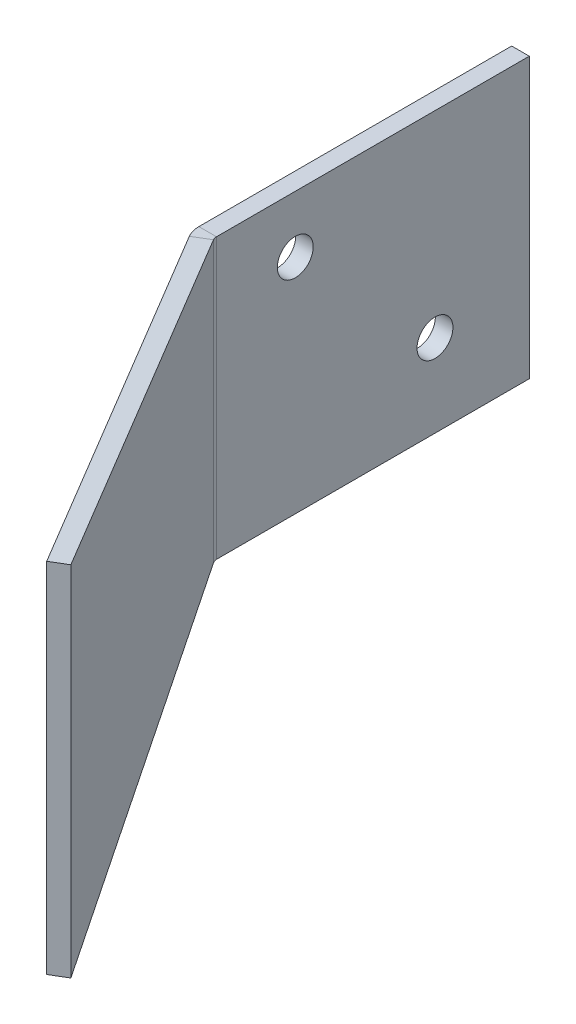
ISO-10303-21;
HEADER;
FILE_DESCRIPTION(('STEP AP214'),'2;1');
FILE_NAME('part.step','',(''),(''),'','','');
FILE_SCHEMA(('AUTOMOTIVE_DESIGN { 1 0 10303 214 1 1 1 1 }'));
ENDSEC;
DATA;
#1=APPLICATION_CONTEXT('core data for automotive mechanical design processes');
#2=APPLICATION_PROTOCOL_DEFINITION('international standard','automotive_design',2000,#1);
#3=PRODUCT_CONTEXT('',#1,'mechanical');
#4=PRODUCT('Part','Part','',(#3));
#5=PRODUCT_RELATED_PRODUCT_CATEGORY('part','',(#4));
#6=PRODUCT_DEFINITION_FORMATION('','',#4);
#7=PRODUCT_DEFINITION_CONTEXT('part definition',#1,'design');
#8=PRODUCT_DEFINITION('design','',#6,#7);
#9=PRODUCT_DEFINITION_SHAPE('','',#8);
#10=(LENGTH_UNIT() NAMED_UNIT(*) SI_UNIT(.MILLI.,.METRE.));
#11=(NAMED_UNIT(*) PLANE_ANGLE_UNIT() SI_UNIT($,.RADIAN.));
#12=(NAMED_UNIT(*) SI_UNIT($,.STERADIAN.) SOLID_ANGLE_UNIT());
#13=UNCERTAINTY_MEASURE_WITH_UNIT(LENGTH_MEASURE(1.E-05),#10,'distance_accuracy_value','');
#14=(GEOMETRIC_REPRESENTATION_CONTEXT(3) GLOBAL_UNCERTAINTY_ASSIGNED_CONTEXT((#13)) GLOBAL_UNIT_ASSIGNED_CONTEXT((#10,
#11,#12)) REPRESENTATION_CONTEXT('',''));
#15=CARTESIAN_POINT('',(0.,0.,0.));
#16=DIRECTION('',(0.,0.,1.));
#17=DIRECTION('',(1.,0.,0.));
#18=AXIS2_PLACEMENT_3D('',#15,#16,#17);
#19=CARTESIAN_POINT('',(-1.6002,-19.396714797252,-15.875));
#20=DIRECTION('',(0.,0.,-1.));
#21=DIRECTION('',(-1.,0.,0.));
#22=AXIS2_PLACEMENT_3D('',#19,#20,#21);
#23=PLANE('',#22);
#24=DIRECTION('',(0.,1.,0.));
#25=VECTOR('',#24,1.);
#26=CARTESIAN_POINT('',(-1.6002,-19.396714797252,-15.875));
#27=LINE('',#26,#25);
#28=CARTESIAN_POINT('',(-1.6002,-19.396714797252,-15.875));
#29=VERTEX_POINT('',#28);
#30=CARTESIAN_POINT('',(-1.6002,6.00328520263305,-15.875));
#31=VERTEX_POINT('',#30);
#32=EDGE_CURVE('E216',#29,#31,#27,.T.);
#33=ORIENTED_EDGE('',*,*,#32,.T.);
#34=DIRECTION('',(1.,0.,0.));
#35=VECTOR('',#34,1.);
#36=CARTESIAN_POINT('',(0.,6.00328520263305,-15.875));
#37=LINE('',#36,#35);
#38=CARTESIAN_POINT('',(0.,6.00328520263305,-15.875));
#39=VERTEX_POINT('',#38);
#40=EDGE_CURVE('E218',#39,#31,#37,.F.);
#41=ORIENTED_EDGE('',*,*,#40,.F.);
#42=DIRECTION('',(0.,1.,0.));
#43=VECTOR('',#42,1.);
#44=CARTESIAN_POINT('',(0.,-19.396714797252,-15.875));
#45=LINE('',#44,#43);
#46=CARTESIAN_POINT('',(0.,-19.396714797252,-15.875));
#47=VERTEX_POINT('',#46);
#48=EDGE_CURVE('E225',#47,#39,#45,.T.);
#49=ORIENTED_EDGE('',*,*,#48,.F.);
#50=DIRECTION('',(1.,0.,0.));
#51=VECTOR('',#50,1.);
#52=CARTESIAN_POINT('',(-1.6002,-19.396714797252,-15.875));
#53=LINE('',#52,#51);
#54=EDGE_CURVE('E13',#29,#47,#53,.T.);
#55=ORIENTED_EDGE('',*,*,#54,.F.);
#56=EDGE_LOOP('',(#33,#41,#49,#55));
#57=FACE_BOUND('',#56,.T.);
#58=ADVANCED_FACE('F59',(#57),#23,.T.);
#59=CARTESIAN_POINT('',(0.73660000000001,-19.4327343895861,12.5637679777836));
#60=DIRECTION('',(0.,-1.,0.));
#61=DIRECTION('',(-0.857167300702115,0.,0.515038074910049));
#62=AXIS2_PLACEMENT_3D('',#59,#60,#61);
#63=CYLINDRICAL_SURFACE('',#62,2.33679999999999);
#64=DIRECTION('',(0.,-1.,0.));
#65=VECTOR('',#64,1.);
#66=CARTESIAN_POINT('',(-1.26642854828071,19.396714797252,13.7673089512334));
#67=LINE('',#66,#65);
#68=CARTESIAN_POINT('',(-1.2664285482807,-19.4327343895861,13.7673089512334));
#69=VERTEX_POINT('',#68);
#70=CARTESIAN_POINT('',(-1.26642854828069,6.00810081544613,13.7673089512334));
#71=VERTEX_POINT('',#70);
#72=EDGE_CURVE('E145',#69,#71,#67,.F.);
#73=ORIENTED_EDGE('',*,*,#72,.T.);
#74=CARTESIAN_POINT('',(-1.2664285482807,6.00810081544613,13.7673089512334));
#75=CARTESIAN_POINT('',(-1.27999492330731,6.00800049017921,13.7447310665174));
#76=CARTESIAN_POINT('',(-1.29317923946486,6.00790016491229,13.7219236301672));
#77=CARTESIAN_POINT('',(-1.31876938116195,6.00769951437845,13.6758761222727));
#78=CARTESIAN_POINT('',(-1.3311752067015,6.00759918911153,13.6526360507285));
#79=CARTESIAN_POINT('',(-1.35519399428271,6.00739853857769,13.6057497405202));
#80=CARTESIAN_POINT('',(-1.36680695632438,6.00729821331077,13.5821035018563));
#81=CARTESIAN_POINT('',(-1.38922678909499,6.00709756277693,13.5344319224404));
#82=CARTESIAN_POINT('',(-1.40003365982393,6.00699723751,13.5104065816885));
#83=CARTESIAN_POINT('',(-1.42082893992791,6.00679658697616,13.4620042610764));
#84=CARTESIAN_POINT('',(-1.43081734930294,6.00669626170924,13.4376272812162));
#85=CARTESIAN_POINT('',(-1.44996428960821,6.0064956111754,13.3885495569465));
#86=CARTESIAN_POINT('',(-1.45912282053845,6.00639528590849,13.363848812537));
#87=CARTESIAN_POINT('',(-1.47659953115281,6.00619463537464,13.3141518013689));
#88=CARTESIAN_POINT('',(-1.48491771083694,6.00609431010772,13.2891555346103));
#89=CARTESIAN_POINT('',(-1.50070420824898,6.00589365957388,13.2388960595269));
#90=CARTESIAN_POINT('',(-1.50817252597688,6.00579333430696,13.213632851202));
#91=CARTESIAN_POINT('',(-1.52225076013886,6.00559268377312,13.1628683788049));
#92=CARTESIAN_POINT('',(-1.52886067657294,6.0054923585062,13.1373671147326));
#93=CARTESIAN_POINT('',(-1.5412145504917,6.00529170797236,13.0861556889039));
#94=CARTESIAN_POINT('',(-1.54695850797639,6.00519138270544,13.0604455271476));
#95=CARTESIAN_POINT('',(-1.55757389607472,6.0049907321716,13.0088457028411));
#96=CARTESIAN_POINT('',(-1.56244532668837,6.00489040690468,12.9829560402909));
#97=CARTESIAN_POINT('',(-1.57131009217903,6.00468975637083,12.9310268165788));
#98=CARTESIAN_POINT('',(-1.57530342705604,6.00458943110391,12.9049872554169));
#99=CARTESIAN_POINT('',(-1.58240743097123,6.00438878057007,12.8527880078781));
#100=CARTESIAN_POINT('',(-1.58551810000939,6.00428845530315,12.8266283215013));
#101=CARTESIAN_POINT('',(-1.59085323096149,6.00408780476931,12.7742187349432));
#102=CARTESIAN_POINT('',(-1.59307769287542,6.00398747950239,12.7479688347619));
#103=CARTESIAN_POINT('',(-1.59663780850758,6.00378682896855,12.6954088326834));
#104=CARTESIAN_POINT('',(-1.59797346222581,6.00368650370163,12.6690987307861));
#105=CARTESIAN_POINT('',(-1.59975464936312,6.00348585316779,12.6164484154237));
#106=CARTESIAN_POINT('',(-1.6002001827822,6.00338552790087,12.5901082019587));
#107=CARTESIAN_POINT('',(-1.6002,6.00328520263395,12.5637679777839));
#108=B_SPLINE_CURVE_WITH_KNOTS('',3,(#74,#75,#76,#77,#78,#79,#80,#81,#82,#83,#84,#85,#86,#87,
#88,#89,#90,#91,#92,#93,#94,#95,#96,#97,#98,#99,#100,#101,#102,#103,#104,#105,#106,#107),
.UNSPECIFIED.,.F.,.F.,(4,2,2,2,2,2,2,2,2,2,2,2,2,2,2,2,4),(0.,0.0790174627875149,
0.158034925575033,0.237052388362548,0.316069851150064,0.39508731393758,0.474104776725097,
0.553122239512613,0.632139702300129,0.711157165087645,0.790174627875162,0.869192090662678,
0.948209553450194,1.02722701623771,1.10624447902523,1.18526194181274,1.26427940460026),.UNSPECIFIED.);
#109=CARTESIAN_POINT('',(-1.6002,6.0032852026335,12.5637679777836));
#110=VERTEX_POINT('',#109);
#111=EDGE_CURVE('E253',#71,#110,#108,.T.);
#112=ORIENTED_EDGE('',*,*,#111,.T.);
#113=DIRECTION('',(0.,-1.,0.));
#114=VECTOR('',#113,1.);
#115=CARTESIAN_POINT('',(-1.60019999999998,-19.4327343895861,12.5637679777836));
#116=LINE('',#115,#114);
#117=CARTESIAN_POINT('',(-1.60019999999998,-19.396714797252,12.5637679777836));
#118=VERTEX_POINT('',#117);
#119=EDGE_CURVE('E231',#118,#110,#116,.F.);
#120=ORIENTED_EDGE('',*,*,#119,.F.);
#121=CARTESIAN_POINT('',(-1.26642854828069,-19.4327343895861,13.7673089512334));
#122=CARTESIAN_POINT('',(-1.2799949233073,-19.4319839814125,13.7447310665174));
#123=CARTESIAN_POINT('',(-1.29317923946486,-19.4312335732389,13.7219236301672));
#124=CARTESIAN_POINT('',(-1.31876938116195,-19.4297327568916,13.6758761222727));
#125=CARTESIAN_POINT('',(-1.3311752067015,-19.428982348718,13.6526360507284));
#126=CARTESIAN_POINT('',(-1.35519399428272,-19.4274815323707,13.6057497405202));
#127=CARTESIAN_POINT('',(-1.3668069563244,-19.4267311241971,13.5821035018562));
#128=CARTESIAN_POINT('',(-1.38922678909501,-19.4252303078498,13.5344319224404));
#129=CARTESIAN_POINT('',(-1.40003365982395,-19.4244798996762,13.5104065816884));
#130=CARTESIAN_POINT('',(-1.42082893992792,-19.422979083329,13.4620042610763));
#131=CARTESIAN_POINT('',(-1.43081734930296,-19.4222286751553,13.4376272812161));
#132=CARTESIAN_POINT('',(-1.44996428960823,-19.4207278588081,13.3885495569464));
#133=CARTESIAN_POINT('',(-1.45912282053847,-19.4199774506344,13.3638488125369));
#134=CARTESIAN_POINT('',(-1.47659953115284,-19.4184766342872,13.3141518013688));
#135=CARTESIAN_POINT('',(-1.48491771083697,-19.4177262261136,13.2891555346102));
#136=CARTESIAN_POINT('',(-1.500704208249,-19.4162254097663,13.2388960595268));
#137=CARTESIAN_POINT('',(-1.50817252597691,-19.4154750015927,13.2136328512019));
#138=CARTESIAN_POINT('',(-1.52225076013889,-19.4139741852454,13.1628683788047));
#139=CARTESIAN_POINT('',(-1.52886067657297,-19.4132237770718,13.1373671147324));
#140=CARTESIAN_POINT('',(-1.54121455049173,-19.4117229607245,13.0861556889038));
#141=CARTESIAN_POINT('',(-1.54695850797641,-19.4109725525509,13.0604455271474));
#142=CARTESIAN_POINT('',(-1.55757389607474,-19.4094717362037,13.0088457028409));
#143=CARTESIAN_POINT('',(-1.56244532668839,-19.40872132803,12.9829560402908));
#144=CARTESIAN_POINT('',(-1.57131009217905,-19.4072205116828,12.9310268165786));
#145=CARTESIAN_POINT('',(-1.57530342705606,-19.4064701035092,12.9049872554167));
#146=CARTESIAN_POINT('',(-1.58240743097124,-19.4049692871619,12.8527880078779));
#147=CARTESIAN_POINT('',(-1.5855181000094,-19.4042188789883,12.8266283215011));
#148=CARTESIAN_POINT('',(-1.5908532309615,-19.402718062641,12.774218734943));
#149=CARTESIAN_POINT('',(-1.59307769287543,-19.4019676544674,12.7479688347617));
#150=CARTESIAN_POINT('',(-1.59663780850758,-19.4004668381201,12.6954088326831));
#151=CARTESIAN_POINT('',(-1.59797346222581,-19.3997164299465,12.6690987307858));
#152=CARTESIAN_POINT('',(-1.59975464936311,-19.3982156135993,12.6164484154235));
#153=CARTESIAN_POINT('',(-1.60020018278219,-19.3974652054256,12.5901082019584));
#154=CARTESIAN_POINT('',(-1.60019999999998,-19.396714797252,12.5637679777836));
#155=B_SPLINE_CURVE_WITH_KNOTS('',3,(#121,#122,#123,#124,#125,#126,#127,#128,#129,#130,#131,
#132,#133,#134,#135,#136,#137,#138,#139,#140,#141,#142,#143,#144,#145,#146,#147,#148,#149,#150,
#151,#152,#153,#154),.UNSPECIFIED.,.F.,.F.,(4,2,2,2,2,2,2,2,2,2,2,2,2,2,2,2,4),(0.,
0.0790489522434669,0.158097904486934,0.237146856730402,0.31619580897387,0.395244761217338,
0.474293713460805,0.553342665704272,0.63239161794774,0.711440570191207,0.790489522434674,
0.869538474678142,0.948587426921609,1.02763637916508,1.10668533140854,1.18573428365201,
1.26478323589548),.UNSPECIFIED.);
#156=EDGE_CURVE('E164',#69,#118,#155,.T.);
#157=ORIENTED_EDGE('',*,*,#156,.F.);
#158=EDGE_LOOP('',(#73,#112,#120,#157));
#159=FACE_BOUND('',#158,.T.);
#160=ADVANCED_FACE('F178',(#159),#63,.T.);
#161=CARTESIAN_POINT('',(0.73660000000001,-19.4327343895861,12.5637679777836));
#162=DIRECTION('',(0.,-1.,0.));
#163=DIRECTION('',(-0.857167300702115,0.,0.515038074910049));
#164=AXIS2_PLACEMENT_3D('',#161,#162,#163);
#165=CYLINDRICAL_SURFACE('',#164,0.736599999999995);
#166=CARTESIAN_POINT('',(0.105210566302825,6.00810081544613,12.9431450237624));
#167=CARTESIAN_POINT('',(0.10093420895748,6.00800049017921,12.936028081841));
#168=CARTESIAN_POINT('',(0.0967782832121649,6.00790016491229,12.9288387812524));
#169=CARTESIAN_POINT('',(0.0887118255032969,6.00769951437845,12.9143238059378));
#170=CARTESIAN_POINT('',(0.0848012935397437,6.00759918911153,12.9069981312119));
#171=CARTESIAN_POINT('',(0.0772301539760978,6.00739853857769,12.8922187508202));
#172=CARTESIAN_POINT('',(0.0735695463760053,6.00729821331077,12.8847650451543));
#173=CARTESIAN_POINT('',(0.066502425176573,6.00709756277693,12.8697381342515));
#174=CARTESIAN_POINT('',(0.0630959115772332,6.00699723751,12.8621649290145));
#175=CARTESIAN_POINT('',(0.0565408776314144,6.00679658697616,12.8469076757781));
#176=CARTESIAN_POINT('',(0.0533923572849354,6.00669626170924,12.8392236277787));
#177=CARTESIAN_POINT('',(0.0473569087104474,6.0064956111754,12.8237534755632));
#178=CARTESIAN_POINT('',(0.0444699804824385,6.00639528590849,12.8159673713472));
#179=CARTESIAN_POINT('',(0.0389610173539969,6.00619463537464,12.8003020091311));
#180=CARTESIAN_POINT('',(0.0363389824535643,6.00609431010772,12.7924227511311));
#181=CARTESIAN_POINT('',(0.0313628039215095,6.00589365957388,12.776580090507));
#182=CARTESIAN_POINT('',(0.0290086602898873,6.00579333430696,12.7686166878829));
#183=CARTESIAN_POINT('',(0.0245709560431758,6.00559268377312,12.7526148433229));
#184=CARTESIAN_POINT('',(0.0224873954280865,6.0054923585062,12.7445764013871));
#185=CARTESIAN_POINT('',(0.0185932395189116,6.00529170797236,12.7284336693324));
#186=CARTESIAN_POINT('',(0.016782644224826,6.00519138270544,12.7203293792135));
#187=CARTESIAN_POINT('',(0.013436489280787,6.0049907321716,12.7040642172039));
#188=CARTESIAN_POINT('',(0.0119009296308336,6.00489040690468,12.6959033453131));
#189=CARTESIAN_POINT('',(0.00910660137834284,6.00468975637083,12.6795343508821));
#190=CARTESIAN_POINT('',(0.00784783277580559,6.00458943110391,12.6713262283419));
#191=CARTESIAN_POINT('',(0.00560852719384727,6.00438878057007,12.6548721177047));
#192=CARTESIAN_POINT('',(0.00462799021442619,6.00428845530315,12.6466261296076));
#193=CARTESIAN_POINT('',(0.00294626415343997,6.00408780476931,12.6301057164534));
#194=CARTESIAN_POINT('',(0.00224507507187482,6.00398747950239,12.6218312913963));
#195=CARTESIAN_POINT('',(0.00112286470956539,6.00378682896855,12.6052634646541));
#196=CARTESIAN_POINT('',(0.000701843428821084,6.00368650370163,12.5969700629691));
#197=CARTESIAN_POINT('',(0.000140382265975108,6.00348585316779,12.5803737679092));
#198=CARTESIAN_POINT('',(-5.76161265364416E-08,6.00338552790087,12.5720708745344));
#199=CARTESIAN_POINT('',(0.,6.00328520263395,12.5637679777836));
#200=B_SPLINE_CURVE_WITH_KNOTS('',3,(#166,#167,#168,#169,#170,#171,#172,#173,#174,#175,#176,
#177,#178,#179,#180,#181,#182,#183,#184,#185,#186,#187,#188,#189,#190,#191,#192,#193,#194,#195,
#196,#197,#198,#199),.UNSPECIFIED.,.F.,.F.,(4,2,2,2,2,2,2,2,2,2,2,2,2,2,2,2,4),(0.,
0.0249093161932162,0.0498186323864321,0.0747279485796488,0.099637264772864,0.124546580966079,
0.149455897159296,0.174365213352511,0.199274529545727,0.224183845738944,0.249093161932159,
0.274002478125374,0.298911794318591,0.323821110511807,0.348730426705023,0.373639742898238,
0.398549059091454),.UNSPECIFIED.);
#201=CARTESIAN_POINT('',(0.105210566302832,6.00810081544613,12.9431450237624));
#202=VERTEX_POINT('',#201);
#203=CARTESIAN_POINT('',(0.,6.00328520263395,12.5637679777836));
#204=VERTEX_POINT('',#203);
#205=EDGE_CURVE('E237',#202,#204,#200,.T.);
#206=ORIENTED_EDGE('',*,*,#205,.F.);
#207=DIRECTION('',(0.,-1.,0.));
#208=VECTOR('',#207,1.);
#209=CARTESIAN_POINT('',(0.105210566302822,19.396714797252,12.9431450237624));
#210=LINE('',#209,#208);
#211=CARTESIAN_POINT('',(0.105210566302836,-19.4327343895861,12.9431450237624));
#212=VERTEX_POINT('',#211);
#213=EDGE_CURVE('E137',#202,#212,#210,.T.);
#214=ORIENTED_EDGE('',*,*,#213,.T.);
#215=CARTESIAN_POINT('',(0.105210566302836,-19.4327343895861,12.9431450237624));
#216=CARTESIAN_POINT('',(0.10093420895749,-19.4319839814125,12.936028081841));
#217=CARTESIAN_POINT('',(0.0967782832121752,-19.4312335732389,12.9288387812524));
#218=CARTESIAN_POINT('',(0.0887118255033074,-19.4297327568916,12.9143238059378));
#219=CARTESIAN_POINT('',(0.0848012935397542,-19.428982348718,12.9069981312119));
#220=CARTESIAN_POINT('',(0.0772301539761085,-19.4274815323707,12.8922187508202));
#221=CARTESIAN_POINT('',(0.073569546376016,-19.4267311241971,12.8847650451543));
#222=CARTESIAN_POINT('',(0.0665024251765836,-19.4252303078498,12.8697381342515));
#223=CARTESIAN_POINT('',(0.0630959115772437,-19.4244798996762,12.8621649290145));
#224=CARTESIAN_POINT('',(0.0565408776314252,-19.422979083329,12.8469076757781));
#225=CARTESIAN_POINT('',(0.0533923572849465,-19.4222286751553,12.8392236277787));
#226=CARTESIAN_POINT('',(0.0473569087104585,-19.4207278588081,12.8237534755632));
#227=CARTESIAN_POINT('',(0.0444699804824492,-19.4199774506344,12.8159673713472));
#228=CARTESIAN_POINT('',(0.0389610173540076,-19.4184766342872,12.8003020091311));
#229=CARTESIAN_POINT('',(0.0363389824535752,-19.4177262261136,12.7924227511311));
#230=CARTESIAN_POINT('',(0.0313628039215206,-19.4162254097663,12.776580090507));
#231=CARTESIAN_POINT('',(0.0290086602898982,-19.4154750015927,12.7686166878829));
#232=CARTESIAN_POINT('',(0.0245709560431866,-19.4139741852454,12.7526148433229));
#233=CARTESIAN_POINT('',(0.0224873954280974,-19.4132237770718,12.7445764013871));
#234=CARTESIAN_POINT('',(0.0185932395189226,-19.4117229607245,12.7284336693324));
#235=CARTESIAN_POINT('',(0.016782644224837,-19.4109725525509,12.7203293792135));
#236=CARTESIAN_POINT('',(0.0134364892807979,-19.4094717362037,12.7040642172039));
#237=CARTESIAN_POINT('',(0.0119009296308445,-19.40872132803,12.6959033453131));
#238=CARTESIAN_POINT('',(0.00910660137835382,-19.4072205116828,12.6795343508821));
#239=CARTESIAN_POINT('',(0.00784783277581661,-19.4064701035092,12.6713262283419));
#240=CARTESIAN_POINT('',(0.00560852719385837,-19.4049692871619,12.6548721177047));
#241=CARTESIAN_POINT('',(0.00462799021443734,-19.4042188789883,12.6466261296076));
#242=CARTESIAN_POINT('',(0.00294626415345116,-19.402718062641,12.6301057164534));
#243=CARTESIAN_POINT('',(0.00224507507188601,-19.4019676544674,12.6218312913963));
#244=CARTESIAN_POINT('',(0.00112286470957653,-19.4004668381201,12.6052634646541));
#245=CARTESIAN_POINT('',(0.000701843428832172,-19.3997164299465,12.5969700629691));
#246=CARTESIAN_POINT('',(0.000140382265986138,-19.3982156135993,12.5803737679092));
#247=CARTESIAN_POINT('',(-5.76161155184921E-08,-19.3974652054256,12.5720708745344));
#248=CARTESIAN_POINT('',(0.,-19.396714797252,12.5637679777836));
#249=B_SPLINE_CURVE_WITH_KNOTS('',3,(#215,#216,#217,#218,#219,#220,#221,#222,#223,#224,#225,
#226,#227,#228,#229,#230,#231,#232,#233,#234,#235,#236,#237,#238,#239,#240,#241,#242,#243,#244,
#245,#246,#247,#248),.UNSPECIFIED.,.F.,.F.,(4,2,2,2,2,2,2,2,2,2,2,2,2,2,2,2,4),(0.,
0.0250090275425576,0.0500180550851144,0.0750270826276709,0.100036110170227,0.125045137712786,
0.150054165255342,0.1750631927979,0.200072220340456,0.225081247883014,0.25009027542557,
0.275099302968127,0.300108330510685,0.325117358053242,0.350126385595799,0.375135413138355,
0.400144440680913),.UNSPECIFIED.);
#250=CARTESIAN_POINT('',(0.,-19.396714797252,12.5637679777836));
#251=VERTEX_POINT('',#250);
#252=EDGE_CURVE('E158',#212,#251,#249,.T.);
#253=ORIENTED_EDGE('',*,*,#252,.T.);
#254=DIRECTION('',(0.,-1.,0.));
#255=VECTOR('',#254,1.);
#256=CARTESIAN_POINT('',(0.,-19.4327343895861,12.5637679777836));
#257=LINE('',#256,#255);
#258=EDGE_CURVE('E163',#251,#204,#257,.F.);
#259=ORIENTED_EDGE('',*,*,#258,.T.);
#260=EDGE_LOOP('',(#206,#214,#253,#259));
#261=FACE_BOUND('',#260,.T.);
#262=ADVANCED_FACE('F168',(#261),#165,.F.);
#263=CARTESIAN_POINT('',(-8.38003563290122,0.,1.92827863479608));
#264=DIRECTION('',(0.857167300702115,0.,-0.515038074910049));
#265=DIRECTION('',(-0.515038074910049,0.,-0.857167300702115));
#266=AXIS2_PLACEMENT_3D('',#263,#264,#265);
#267=PLANE('',#266);
#268=DIRECTION('',(-0.515007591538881,-0.0108797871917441,-0.857116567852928));
#269=VECTOR('',#268,1.);
#270=CARTESIAN_POINT('',(-8.41285802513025,5.85712899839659,1.87365300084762));
#271=LINE('',#270,#269);
#272=CARTESIAN_POINT('',(18.2513115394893,6.4204226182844,46.2502833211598));
#273=VERTEX_POINT('',#272);
#274=EDGE_CURVE('E73',#273,#71,#271,.T.);
#275=ORIENTED_EDGE('',*,*,#274,.T.);
#276=ORIENTED_EDGE('',*,*,#72,.F.);
#277=DIRECTION('',(0.507213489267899,-0.173648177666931,0.84414500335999));
#278=VECTOR('',#277,1.);
#279=CARTESIAN_POINT('',(-1.37163911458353,-19.396714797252,13.5922091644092));
#280=LINE('',#279,#278);
#281=CARTESIAN_POINT('',(18.2513115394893,-26.1147727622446,46.2502833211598));
#282=VERTEX_POINT('',#281);
#283=EDGE_CURVE('E286',#282,#69,#280,.F.);
#284=ORIENTED_EDGE('',*,*,#283,.F.);
#285=DIRECTION('',(0.,1.,0.));
#286=VECTOR('',#285,1.);
#287=CARTESIAN_POINT('',(18.2513115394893,-26.1147727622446,46.2502833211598));
#288=LINE('',#287,#286);
#289=EDGE_CURVE('E147',#273,#282,#288,.F.);
#290=ORIENTED_EDGE('',*,*,#289,.F.);
#291=EDGE_LOOP('',(#275,#276,#284,#290));
#292=FACE_BOUND('',#291,.T.);
#293=ADVANCED_FACE('F177',(#292),#267,.F.);
#294=CARTESIAN_POINT('',(-7.00839651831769,0.,1.10411470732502));
#295=DIRECTION('',(0.857167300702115,0.,-0.515038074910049));
#296=DIRECTION('',(-0.515038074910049,0.,-0.857167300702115));
#297=AXIS2_PLACEMENT_3D('',#294,#295,#296);
#298=PLANE('',#297);
#299=ORIENTED_EDGE('',*,*,#213,.F.);
#300=DIRECTION('',(-0.515007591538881,-0.0108797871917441,-0.857116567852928));
#301=VECTOR('',#300,1.);
#302=CARTESIAN_POINT('',(-7.04121891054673,5.85712899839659,1.04948907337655));
#303=LINE('',#302,#301);
#304=CARTESIAN_POINT('',(19.6229506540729,6.4204226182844,45.4261193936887));
#305=VERTEX_POINT('',#304);
#306=EDGE_CURVE('E124',#305,#202,#303,.T.);
#307=ORIENTED_EDGE('',*,*,#306,.F.);
#308=DIRECTION('',(0.,-1.,0.));
#309=VECTOR('',#308,1.);
#310=CARTESIAN_POINT('',(19.6229506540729,0.,45.4261193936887));
#311=LINE('',#310,#309);
#312=CARTESIAN_POINT('',(19.6229506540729,-26.1147727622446,45.4261193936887));
#313=VERTEX_POINT('',#312);
#314=EDGE_CURVE('E135',#305,#313,#311,.T.);
#315=ORIENTED_EDGE('',*,*,#314,.T.);
#316=DIRECTION('',(-0.507213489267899,0.173648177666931,-0.84414500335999));
#317=VECTOR('',#316,1.);
#318=CARTESIAN_POINT('',(-8.50546609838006,-16.4848074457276,-1.38742747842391));
#319=LINE('',#318,#317);
#320=EDGE_CURVE('E144',#313,#212,#319,.T.);
#321=ORIENTED_EDGE('',*,*,#320,.T.);
#322=EDGE_LOOP('',(#299,#307,#315,#321));
#323=FACE_BOUND('',#322,.T.);
#324=ADVANCED_FACE('F133',(#323),#298,.T.);
#325=CARTESIAN_POINT('',(18.2513115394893,-26.1147727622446,46.2502833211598));
#326=DIRECTION('',(0.515038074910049,0.,0.857167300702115));
#327=DIRECTION('',(0.857167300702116,0.,-0.515038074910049));
#328=AXIS2_PLACEMENT_3D('',#325,#326,#327);
#329=PLANE('',#328);
#330=ORIENTED_EDGE('',*,*,#314,.F.);
#331=DIRECTION('',(0.857167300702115,0.,-0.515038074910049));
#332=VECTOR('',#331,1.);
#333=CARTESIAN_POINT('',(19.6229506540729,6.42042261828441,45.4261193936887));
#334=LINE('',#333,#332);
#335=EDGE_CURVE('E121',#305,#273,#334,.F.);
#336=ORIENTED_EDGE('',*,*,#335,.T.);
#337=ORIENTED_EDGE('',*,*,#289,.T.);
#338=DIRECTION('',(0.857167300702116,0.,-0.515038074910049));
#339=VECTOR('',#338,1.);
#340=CARTESIAN_POINT('',(18.2513115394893,-26.1147727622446,46.2502833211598));
#341=LINE('',#340,#339);
#342=EDGE_CURVE('E142',#282,#313,#341,.T.);
#343=ORIENTED_EDGE('',*,*,#342,.T.);
#344=EDGE_LOOP('',(#330,#336,#337,#343));
#345=FACE_BOUND('',#344,.T.);
#346=ADVANCED_FACE('F140',(#345),#329,.T.);
#347=CARTESIAN_POINT('',(-1.6002,-19.396714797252,15.875));
#348=DIRECTION('',(0.,-1.,0.));
#349=DIRECTION('',(0.,0.,-1.));
#350=AXIS2_PLACEMENT_3D('',#347,#348,#349);
#351=PLANE('',#350);
#352=DIRECTION('',(0.,0.,-1.));
#353=VECTOR('',#352,1.);
#354=CARTESIAN_POINT('',(0.,-19.396714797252,15.875));
#355=LINE('',#354,#353);
#356=EDGE_CURVE('E222',#251,#47,#355,.T.);
#357=ORIENTED_EDGE('',*,*,#356,.F.);
#358=DIRECTION('',(-1.,0.,0.));
#359=VECTOR('',#358,1.);
#360=CARTESIAN_POINT('',(0.,-19.396714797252,12.5637679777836));
#361=LINE('',#360,#359);
#362=EDGE_CURVE('E227',#251,#118,#361,.T.);
#363=ORIENTED_EDGE('',*,*,#362,.T.);
#364=DIRECTION('',(0.,0.,-1.));
#365=VECTOR('',#364,1.);
#366=CARTESIAN_POINT('',(-1.6002,-19.396714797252,15.875));
#367=LINE('',#366,#365);
#368=EDGE_CURVE('E66',#118,#29,#367,.T.);
#369=ORIENTED_EDGE('',*,*,#368,.T.);
#370=ORIENTED_EDGE('',*,*,#54,.T.);
#371=EDGE_LOOP('',(#357,#363,#369,#370));
#372=FACE_BOUND('',#371,.T.);
#373=ADVANCED_FACE('F198',(#372),#351,.T.);
#374=CARTESIAN_POINT('',(-1.6002,0.,0.));
#375=DIRECTION('',(-1.,0.,0.));
#376=DIRECTION('',(0.,0.,1.));
#377=AXIS2_PLACEMENT_3D('',#374,#375,#376);
#378=PLANE('',#377);
#379=CARTESIAN_POINT('',(-1.6002,-11.878314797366,-7.29926602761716));
#380=DIRECTION('',(-1.,0.,0.));
#381=DIRECTION('',(0.,0.,1.));
#382=AXIS2_PLACEMENT_3D('',#379,#380,#381);
#383=CIRCLE('',#382,1.63194999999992);
#384=CARTESIAN_POINT('',(-1.6002,-11.878314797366,-5.66731602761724));
#385=VERTEX_POINT('',#384);
#386=EDGE_CURVE('E298',#385,#385,#383,.T.);
#387=ORIENTED_EDGE('',*,*,#386,.F.);
#388=EDGE_LOOP('',(#387));
#389=FACE_BOUND('',#388,.T.);
#390=CARTESIAN_POINT('',(-1.6002,0.82168520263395,5.40073397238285));
#391=DIRECTION('',(-1.,0.,0.));
#392=DIRECTION('',(0.,0.,1.));
#393=AXIS2_PLACEMENT_3D('',#390,#391,#392);
#394=CIRCLE('',#393,1.63194999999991);
#395=CARTESIAN_POINT('',(-1.6002,0.82168520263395,7.03268397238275));
#396=VERTEX_POINT('',#395);
#397=EDGE_CURVE('E291',#396,#396,#394,.T.);
#398=ORIENTED_EDGE('',*,*,#397,.F.);
#399=EDGE_LOOP('',(#398));
#400=FACE_BOUND('',#399,.T.);
#401=ORIENTED_EDGE('',*,*,#119,.T.);
#402=DIRECTION('',(0.,0.,1.));
#403=VECTOR('',#402,1.);
#404=CARTESIAN_POINT('',(-1.6002,6.00328520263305,0.));
#405=LINE('',#404,#403);
#406=EDGE_CURVE('E244',#31,#110,#405,.T.);
#407=ORIENTED_EDGE('',*,*,#406,.F.);
#408=ORIENTED_EDGE('',*,*,#32,.F.);
#409=ORIENTED_EDGE('',*,*,#368,.F.);
#410=EDGE_LOOP('',(#401,#407,#408,#409));
#411=FACE_BOUND('',#410,.T.);
#412=ADVANCED_FACE('F190',(#389,#400,#411),#378,.T.);
#413=CARTESIAN_POINT('',(0.,0.,0.));
#414=DIRECTION('',(-1.,0.,0.));
#415=DIRECTION('',(0.,0.,1.));
#416=AXIS2_PLACEMENT_3D('',#413,#414,#415);
#417=PLANE('',#416);
#418=DIRECTION('',(0.,0.,1.));
#419=VECTOR('',#418,1.);
#420=CARTESIAN_POINT('',(0.,6.00328520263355,-1.90419665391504E-13));
#421=LINE('',#420,#419);
#422=EDGE_CURVE('E240',#39,#204,#421,.T.);
#423=ORIENTED_EDGE('',*,*,#422,.T.);
#424=ORIENTED_EDGE('',*,*,#258,.F.);
#425=ORIENTED_EDGE('',*,*,#356,.T.);
#426=ORIENTED_EDGE('',*,*,#48,.T.);
#427=EDGE_LOOP('',(#423,#424,#425,#426));
#428=FACE_BOUND('',#427,.T.);
#429=CARTESIAN_POINT('',(0.,-11.878314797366,-7.29926602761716));
#430=DIRECTION('',(-1.,0.,0.));
#431=DIRECTION('',(0.,0.,-1.));
#432=AXIS2_PLACEMENT_3D('',#429,#430,#431);
#433=CIRCLE('',#432,1.63194999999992);
#434=CARTESIAN_POINT('',(0.,-11.878314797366,-8.93121602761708));
#435=VERTEX_POINT('',#434);
#436=EDGE_CURVE('E294',#435,#435,#433,.T.);
#437=ORIENTED_EDGE('',*,*,#436,.T.);
#438=EDGE_LOOP('',(#437));
#439=FACE_BOUND('',#438,.T.);
#440=CARTESIAN_POINT('',(0.,0.82168520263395,5.40073397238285));
#441=DIRECTION('',(-1.,0.,0.));
#442=DIRECTION('',(0.,0.,-1.));
#443=AXIS2_PLACEMENT_3D('',#440,#441,#442);
#444=CIRCLE('',#443,1.63194999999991);
#445=CARTESIAN_POINT('',(0.,0.82168520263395,7.03268397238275));
#446=VERTEX_POINT('',#445);
#447=EDGE_CURVE('E157',#446,#446,#444,.T.);
#448=ORIENTED_EDGE('',*,*,#447,.T.);
#449=EDGE_LOOP('',(#448));
#450=FACE_BOUND('',#449,.T.);
#451=ADVANCED_FACE('F188',(#428,#439,#450),#417,.F.);
#452=CARTESIAN_POINT('',(-1.28014493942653,-19.4327343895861,13.7755505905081));
#453=CARTESIAN_POINT('',(-1.499085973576,-19.4207061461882,13.4111715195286));
#454=CARTESIAN_POINT('',(-1.61620199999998,-19.4087430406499,12.9888647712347));
#455=CARTESIAN_POINT('',(-1.61620199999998,-19.396714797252,12.5637679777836));
#456=CARTESIAN_POINT('',(-1.26642854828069,-19.4327343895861,13.7673089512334));
#457=CARTESIAN_POINT('',(-1.48388050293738,-19.4207061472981,13.4054081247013));
#458=CARTESIAN_POINT('',(-1.60019999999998,-19.40874303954,12.9859735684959));
#459=CARTESIAN_POINT('',(-1.60019999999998,-19.396714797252,12.5637679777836));
#460=CARTESIAN_POINT('',(0.105210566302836,-19.4327343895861,12.9431450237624));
#461=CARTESIAN_POINT('',(0.036666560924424,-19.42070625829,12.829068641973));
#462=CARTESIAN_POINT('',(0.,-19.4087429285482,12.6968532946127));
#463=CARTESIAN_POINT('',(0.,-19.396714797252,12.5637679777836));
#464=B_SPLINE_SURFACE_WITH_KNOTS('',1,3,((#452,#453,#454,#455),(#456,#457,#458,#459),(#460,#461,
#462,#463)),.UNSPECIFIED.,.F.,.F.,.F.,(2,1,2),(4,4),(-0.01,0.,1.),(0.,1.),.UNSPECIFIED.);
#465=DIRECTION('',(-0.857167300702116,0.,0.515038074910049));
#466=VECTOR('',#465,1.);
#467=CARTESIAN_POINT('',(0.105210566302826,-19.4327343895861,12.9431450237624));
#468=LINE('',#467,#466);
#469=EDGE_CURVE('E150',#212,#69,#468,.T.);
#470=ORIENTED_EDGE('',*,*,#252,.F.);
#471=ORIENTED_EDGE('',*,*,#469,.T.);
#472=ORIENTED_EDGE('',*,*,#156,.T.);
#473=ORIENTED_EDGE('',*,*,#362,.F.);
#474=EDGE_LOOP('',(#470,#471,#472,#473));
#475=FACE_BOUND('',#474,.T.);
#476=ADVANCED_FACE('F182',(#475),#464,.F.);
#477=CARTESIAN_POINT('',(-1.37163911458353,-19.396714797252,13.5922091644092));
#478=DIRECTION('',(-0.0894354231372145,-0.984807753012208,-0.148845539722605));
#479=DIRECTION('',(0.,0.14944441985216,-0.988770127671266));
#480=AXIS2_PLACEMENT_3D('',#477,#478,#479);
#481=PLANE('',#480);
#482=ORIENTED_EDGE('',*,*,#283,.T.);
#483=ORIENTED_EDGE('',*,*,#469,.F.);
#484=ORIENTED_EDGE('',*,*,#320,.F.);
#485=ORIENTED_EDGE('',*,*,#342,.F.);
#486=EDGE_LOOP('',(#482,#483,#484,#485));
#487=FACE_BOUND('',#486,.T.);
#488=ADVANCED_FACE('F187',(#487),#481,.T.);
#489=CARTESIAN_POINT('',(-1.28014493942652,6.00810081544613,13.7755505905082));
#490=CARTESIAN_POINT('',(-1.49908618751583,6.00649270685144,13.4111711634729));
#491=CARTESIAN_POINT('',(-1.616202,6.00489331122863,12.9888651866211));
#492=CARTESIAN_POINT('',(-1.616202,6.00328520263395,12.5637679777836));
#493=CARTESIAN_POINT('',(-1.26642854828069,6.00810081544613,13.7673089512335));
#494=CARTESIAN_POINT('',(-1.48388072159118,6.00649270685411,13.4054077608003));
#495=CARTESIAN_POINT('',(-1.6002,6.00489331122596,12.985973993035));
#496=CARTESIAN_POINT('',(-1.6002,6.00328520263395,12.5637679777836));
#497=CARTESIAN_POINT('',(0.105210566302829,6.00810081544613,12.9431450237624));
#498=CARTESIAN_POINT('',(0.0366658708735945,6.00649270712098,12.8290674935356));
#499=CARTESIAN_POINT('',(0.,6.00489331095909,12.6968546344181));
#500=CARTESIAN_POINT('',(0.,6.00328520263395,12.5637679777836));
#501=B_SPLINE_SURFACE_WITH_KNOTS('',1,3,((#489,#490,#491,#492),(#493,#494,#495,#496),(#497,#498,
#499,#500)),.UNSPECIFIED.,.F.,.F.,.F.,(2,1,2),(4,4),(-0.01,0.,1.),(0.,1.),.UNSPECIFIED.);
#502=DIRECTION('',(0.857167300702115,0.,-0.515038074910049));
#503=VECTOR('',#502,1.);
#504=CARTESIAN_POINT('',(0.105210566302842,6.00810081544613,12.9431450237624));
#505=LINE('',#504,#503);
#506=EDGE_CURVE('E138',#202,#71,#505,.F.);
#507=DIRECTION('',(-1.,0.,0.));
#508=VECTOR('',#507,1.);
#509=CARTESIAN_POINT('',(0.,6.00328520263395,12.5637679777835));
#510=LINE('',#509,#508);
#511=EDGE_CURVE('E129',#110,#204,#510,.F.);
#512=ORIENTED_EDGE('',*,*,#506,.F.);
#513=ORIENTED_EDGE('',*,*,#205,.T.);
#514=ORIENTED_EDGE('',*,*,#511,.F.);
#515=ORIENTED_EDGE('',*,*,#111,.F.);
#516=EDGE_LOOP('',(#512,#513,#514,#515));
#517=FACE_BOUND('',#516,.T.);
#518=ADVANCED_FACE('F276',(#517),#501,.T.);
#519=CARTESIAN_POINT('',(0.,6.00328520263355,-1.90419665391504E-13));
#520=DIRECTION('',(0.,-1.,0.));
#521=DIRECTION('',(0.,0.,1.));
#522=AXIS2_PLACEMENT_3D('',#519,#520,#521);
#523=PLANE('',#522);
#524=ORIENTED_EDGE('',*,*,#511,.T.);
#525=ORIENTED_EDGE('',*,*,#422,.F.);
#526=ORIENTED_EDGE('',*,*,#40,.T.);
#527=ORIENTED_EDGE('',*,*,#406,.T.);
#528=EDGE_LOOP('',(#524,#525,#526,#527));
#529=FACE_BOUND('',#528,.T.);
#530=ADVANCED_FACE('F281',(#529),#523,.F.);
#531=CARTESIAN_POINT('',(-7.04121891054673,5.85712899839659,1.04948907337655));
#532=DIRECTION('',(0.00560350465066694,-0.999940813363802,0.0093257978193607));
#533=DIRECTION('',(-0.515007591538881,-0.0108797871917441,-0.857116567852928));
#534=AXIS2_PLACEMENT_3D('',#531,#532,#533);
#535=PLANE('',#534);
#536=ORIENTED_EDGE('',*,*,#306,.T.);
#537=ORIENTED_EDGE('',*,*,#506,.T.);
#538=ORIENTED_EDGE('',*,*,#274,.F.);
#539=ORIENTED_EDGE('',*,*,#335,.F.);
#540=EDGE_LOOP('',(#536,#537,#538,#539));
#541=FACE_BOUND('',#540,.T.);
#542=ADVANCED_FACE('F123',(#541),#535,.F.);
#543=CARTESIAN_POINT('',(0.,0.82168520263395,5.40073397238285));
#544=DIRECTION('',(-1.,0.,0.));
#545=DIRECTION('',(0.,0.,1.));
#546=AXIS2_PLACEMENT_3D('',#543,#544,#545);
#547=CYLINDRICAL_SURFACE('',#546,1.63194999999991);
#548=CARTESIAN_POINT('',(0.,0.82168520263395,7.03268397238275));
#549=CARTESIAN_POINT('',(-0.01666875,0.82168520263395,7.03268397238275));
#550=CARTESIAN_POINT('',(-0.0333375,0.82168520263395,7.03268397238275));
#551=CARTESIAN_POINT('',(-0.066675,0.82168520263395,7.03268397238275));
#552=CARTESIAN_POINT('',(-0.08334375,0.82168520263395,7.03268397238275));
#553=CARTESIAN_POINT('',(-0.11668125,0.82168520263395,7.03268397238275));
#554=CARTESIAN_POINT('',(-0.13335,0.82168520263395,7.03268397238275));
#555=CARTESIAN_POINT('',(-0.1666875,0.82168520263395,7.03268397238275));
#556=CARTESIAN_POINT('',(-0.18335625,0.82168520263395,7.03268397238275));
#557=CARTESIAN_POINT('',(-0.21669375,0.82168520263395,7.03268397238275));
#558=CARTESIAN_POINT('',(-0.2333625,0.82168520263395,7.03268397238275));
#559=CARTESIAN_POINT('',(-0.2667,0.82168520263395,7.03268397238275));
#560=CARTESIAN_POINT('',(-0.28336875,0.82168520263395,7.03268397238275));
#561=CARTESIAN_POINT('',(-0.31670625,0.82168520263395,7.03268397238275));
#562=CARTESIAN_POINT('',(-0.333375,0.82168520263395,7.03268397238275));
#563=CARTESIAN_POINT('',(-0.3667125,0.82168520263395,7.03268397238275));
#564=CARTESIAN_POINT('',(-0.38338125,0.82168520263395,7.03268397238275));
#565=CARTESIAN_POINT('',(-0.41671875,0.82168520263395,7.03268397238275));
#566=CARTESIAN_POINT('',(-0.4333875,0.82168520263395,7.03268397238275));
#567=CARTESIAN_POINT('',(-0.466725,0.82168520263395,7.03268397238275));
#568=CARTESIAN_POINT('',(-0.48339375,0.82168520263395,7.03268397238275));
#569=CARTESIAN_POINT('',(-0.51673125,0.82168520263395,7.03268397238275));
#570=CARTESIAN_POINT('',(-0.5334,0.82168520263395,7.03268397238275));
#571=CARTESIAN_POINT('',(-0.5667375,0.82168520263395,7.03268397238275));
#572=CARTESIAN_POINT('',(-0.58340625,0.82168520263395,7.03268397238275));
#573=CARTESIAN_POINT('',(-0.61674375,0.82168520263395,7.03268397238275));
#574=CARTESIAN_POINT('',(-0.6334125,0.82168520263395,7.03268397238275));
#575=CARTESIAN_POINT('',(-0.66675,0.82168520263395,7.03268397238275));
#576=CARTESIAN_POINT('',(-0.68341875,0.82168520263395,7.03268397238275));
#577=CARTESIAN_POINT('',(-0.71675625,0.82168520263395,7.03268397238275));
#578=CARTESIAN_POINT('',(-0.733425,0.82168520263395,7.03268397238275));
#579=CARTESIAN_POINT('',(-0.7667625,0.82168520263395,7.03268397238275));
#580=CARTESIAN_POINT('',(-0.78343125,0.82168520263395,7.03268397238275));
#581=CARTESIAN_POINT('',(-0.81676875,0.82168520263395,7.03268397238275));
#582=CARTESIAN_POINT('',(-0.8334375,0.82168520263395,7.03268397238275));
#583=CARTESIAN_POINT('',(-0.866775,0.82168520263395,7.03268397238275));
#584=CARTESIAN_POINT('',(-0.88344375,0.82168520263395,7.03268397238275));
#585=CARTESIAN_POINT('',(-0.91678125,0.82168520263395,7.03268397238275));
#586=CARTESIAN_POINT('',(-0.93345,0.82168520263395,7.03268397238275));
#587=CARTESIAN_POINT('',(-0.9667875,0.82168520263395,7.03268397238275));
#588=CARTESIAN_POINT('',(-0.98345625,0.82168520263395,7.03268397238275));
#589=CARTESIAN_POINT('',(-1.01679375,0.82168520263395,7.03268397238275));
#590=CARTESIAN_POINT('',(-1.0334625,0.82168520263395,7.03268397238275));
#591=CARTESIAN_POINT('',(-1.0668,0.82168520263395,7.03268397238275));
#592=CARTESIAN_POINT('',(-1.08346875,0.82168520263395,7.03268397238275));
#593=CARTESIAN_POINT('',(-1.11680625,0.82168520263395,7.03268397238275));
#594=CARTESIAN_POINT('',(-1.133475,0.82168520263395,7.03268397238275));
#595=CARTESIAN_POINT('',(-1.1668125,0.82168520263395,7.03268397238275));
#596=CARTESIAN_POINT('',(-1.18348125,0.82168520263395,7.03268397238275));
#597=CARTESIAN_POINT('',(-1.21681875,0.82168520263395,7.03268397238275));
#598=CARTESIAN_POINT('',(-1.2334875,0.82168520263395,7.03268397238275));
#599=CARTESIAN_POINT('',(-1.266825,0.82168520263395,7.03268397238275));
#600=CARTESIAN_POINT('',(-1.28349375,0.82168520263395,7.03268397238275));
#601=CARTESIAN_POINT('',(-1.31683125,0.82168520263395,7.03268397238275));
#602=CARTESIAN_POINT('',(-1.3335,0.82168520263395,7.03268397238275));
#603=CARTESIAN_POINT('',(-1.3668375,0.82168520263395,7.03268397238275));
#604=CARTESIAN_POINT('',(-1.38350625,0.82168520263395,7.03268397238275));
#605=CARTESIAN_POINT('',(-1.41684375,0.82168520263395,7.03268397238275));
#606=CARTESIAN_POINT('',(-1.4335125,0.82168520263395,7.03268397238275));
#607=CARTESIAN_POINT('',(-1.46685,0.82168520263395,7.03268397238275));
#608=CARTESIAN_POINT('',(-1.48351875,0.82168520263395,7.03268397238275));
#609=CARTESIAN_POINT('',(-1.51685625,0.82168520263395,7.03268397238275));
#610=CARTESIAN_POINT('',(-1.533525,0.82168520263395,7.03268397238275));
#611=CARTESIAN_POINT('',(-1.5668625,0.82168520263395,7.03268397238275));
#612=CARTESIAN_POINT('',(-1.58353125,0.82168520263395,7.03268397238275));
#613=CARTESIAN_POINT('',(-1.6002,0.82168520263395,7.03268397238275));
#614=B_SPLINE_CURVE_WITH_KNOTS('',3,(#548,#549,#550,#551,#552,#553,#554,#555,#556,#557,#558,
#559,#560,#561,#562,#563,#564,#565,#566,#567,#568,#569,#570,#571,#572,#573,#574,#575,#576,#577,
#578,#579,#580,#581,#582,#583,#584,#585,#586,#587,#588,#589,#590,#591,#592,#593,#594,#595,#596,
#597,#598,#599,#600,#601,#602,#603,#604,#605,#606,#607,#608,#609,#610,#611,#612,#613),
.UNSPECIFIED.,.F.,.F.,(4,2,2,2,2,2,2,2,2,2,2,2,2,2,2,2,2,2,2,2,2,2,2,2,2,2,2,2,2,2,2,2,4),(0.,
0.05000625,0.1000125,0.15001875,0.200025,0.25003125,0.3000375,0.35004375,0.40005,0.45005625,
0.5000625,0.55006875,0.600075,0.65008125,0.7000875,0.75009375,0.8001,0.85010625,0.9001125,
0.95011875,1.000125,1.05013125,1.1001375,1.15014375,1.20015,1.25015625,1.3001625,1.35016875,
1.400175,1.45018125,1.5001875,1.55019375,1.6002),.UNSPECIFIED.);
#615=EDGE_CURVE('BSEAM265',#446,#396,#614,.T.);
#616=ORIENTED_EDGE('',*,*,#447,.F.);
#617=ORIENTED_EDGE('',*,*,#397,.T.);
#618=ORIENTED_EDGE('',*,*,#615,.T.);
#619=ORIENTED_EDGE('',*,*,#615,.F.);
#620=EDGE_LOOP('',(#616,#618,#617,#619));
#621=FACE_BOUND('',#620,.T.);
#622=ADVANCED_FACE('F265',(#621),#547,.F.);
#623=CARTESIAN_POINT('',(0.,-11.878314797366,-7.29926602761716));
#624=DIRECTION('',(-1.,0.,0.));
#625=DIRECTION('',(0.,0.,1.));
#626=AXIS2_PLACEMENT_3D('',#623,#624,#625);
#627=CYLINDRICAL_SURFACE('',#626,1.63194999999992);
#628=ORIENTED_EDGE('',*,*,#436,.F.);
#629=EDGE_LOOP('',(#628));
#630=FACE_BOUND('',#629,.T.);
#631=ORIENTED_EDGE('',*,*,#386,.T.);
#632=EDGE_LOOP('',(#631));
#633=FACE_BOUND('',#632,.T.);
#634=ADVANCED_FACE('F268',(#630,#633),#627,.F.);
#635=CLOSED_SHELL('',(#58,#160,#262,#293,#324,#346,#373,#412,#451,#476,#488,#518,#530,#542,#622,#634));
#636=MANIFOLD_SOLID_BREP('B2',#635);
#637=ADVANCED_BREP_SHAPE_REPRESENTATION('',(#18,#636),#14);
#638=SHAPE_DEFINITION_REPRESENTATION(#9,#637);
ENDSEC;
END-ISO-10303-21;
